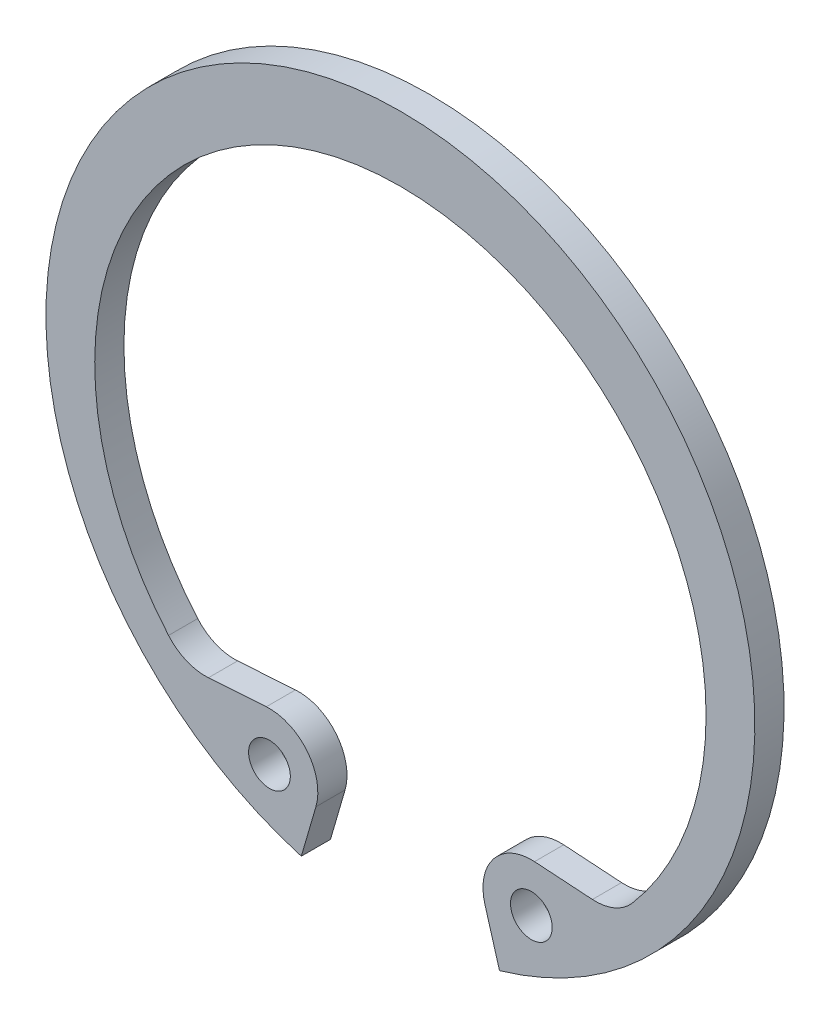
from build123d import *

# Parameters (mm, degrees)
ESQUISSE1_R          = 1.25
BASE_EXTRUSION_DEPTH = 1.75


with BuildPart() as part:
    # Esquisse1 → Base-Extrusion (new body)
    with BuildSketch(Plane.XY):
        with BuildLine():
            Line((5.065867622, -17.396823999), (5.941130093, -20.402584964))
            ThreePointArc((5.941130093, -20.402584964), (0, 21.25), (-5.941130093, -20.402584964))
            Line((-5.941130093, -20.402584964), (-5.065867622, -17.396823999))
            ThreePointArc((-5.065867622, -17.396823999), (-5.589021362, -14.770275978), (-8.0406322, -13.69229238))
            Line((-8.0406322, -13.69229238), (-11.509657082, -13.920558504))
            ThreePointArc((-11.509657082, -13.920558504), (-12.823131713, -13.700527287), (-13.899757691, -12.916623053))
            ThreePointArc((-13.899757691, -12.916623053), (0, 17.35), (13.899757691, -12.916623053))
            ThreePointArc((13.899757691, -12.916623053), (12.823131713, -13.700527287), (11.509657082, -13.920558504))
            Line((11.509657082, -13.920558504), (8.0406322, -13.69229238))
            ThreePointArc((8.0406322, -13.69229238), (5.589021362, -14.770275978), (5.065867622, -17.396823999))
        make_face()
        with Locations((7.850220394, -16.58603448)):
            Circle(ESQUISSE1_R, mode=Mode.SUBTRACT)
        with Locations(Location((-7.850220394, -16.58603448, 0), (0, 0, 180))):
            Circle(ESQUISSE1_R, mode=Mode.SUBTRACT)
    extrude(amount=BASE_EXTRUSION_DEPTH)


solid = part.part
